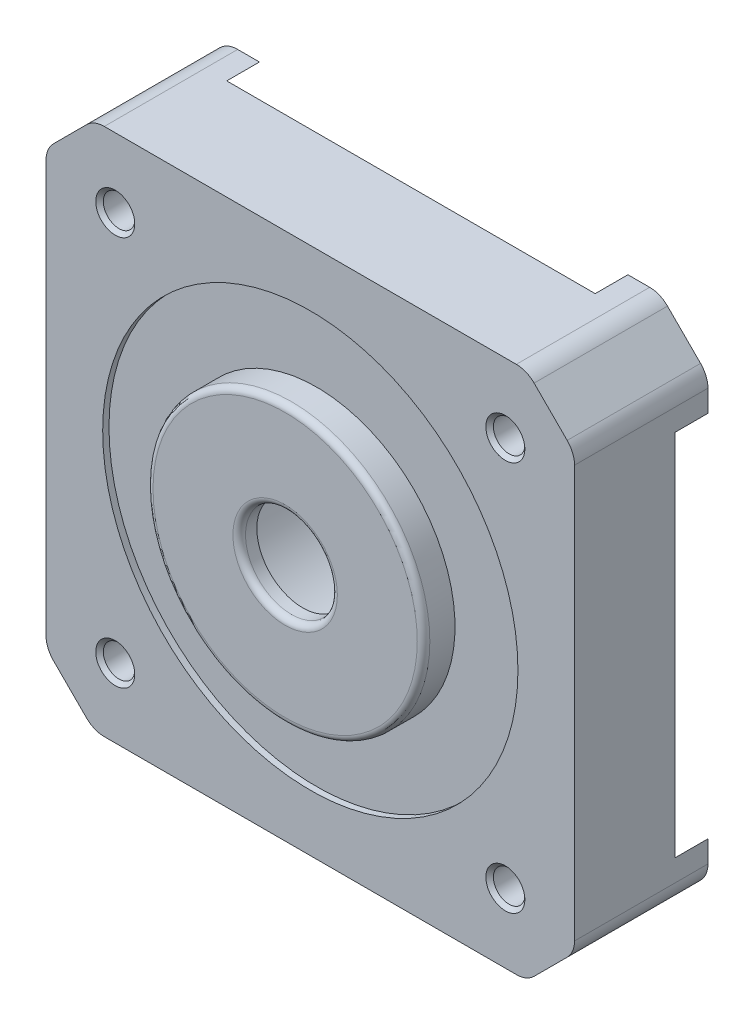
ISO-10303-21;
HEADER;
FILE_DESCRIPTION(('STEP AP214'),'2;1');
FILE_NAME('part.step','',(''),(''),'','','');
FILE_SCHEMA(('AUTOMOTIVE_DESIGN { 1 0 10303 214 1 1 1 1 }'));
ENDSEC;
DATA;
#1=APPLICATION_CONTEXT('core data for automotive mechanical design processes');
#2=APPLICATION_PROTOCOL_DEFINITION('international standard','automotive_design',2000,#1);
#3=PRODUCT_CONTEXT('',#1,'mechanical');
#4=PRODUCT('Part','Part','',(#3));
#5=PRODUCT_RELATED_PRODUCT_CATEGORY('part','',(#4));
#6=PRODUCT_DEFINITION_FORMATION('','',#4);
#7=PRODUCT_DEFINITION_CONTEXT('part definition',#1,'design');
#8=PRODUCT_DEFINITION('design','',#6,#7);
#9=PRODUCT_DEFINITION_SHAPE('','',#8);
#10=(LENGTH_UNIT() NAMED_UNIT(*) SI_UNIT(.MILLI.,.METRE.));
#11=(NAMED_UNIT(*) PLANE_ANGLE_UNIT() SI_UNIT($,.RADIAN.));
#12=(NAMED_UNIT(*) SI_UNIT($,.STERADIAN.) SOLID_ANGLE_UNIT());
#13=UNCERTAINTY_MEASURE_WITH_UNIT(LENGTH_MEASURE(1.E-05),#10,'distance_accuracy_value','');
#14=(GEOMETRIC_REPRESENTATION_CONTEXT(3) GLOBAL_UNCERTAINTY_ASSIGNED_CONTEXT((#13)) GLOBAL_UNIT_ASSIGNED_CONTEXT((#10,
#11,#12)) REPRESENTATION_CONTEXT('',''));
#15=CARTESIAN_POINT('',(0.,0.,0.));
#16=DIRECTION('',(0.,0.,1.));
#17=DIRECTION('',(1.,0.,0.));
#18=AXIS2_PLACEMENT_3D('',#15,#16,#17);
#19=CARTESIAN_POINT('',(0.,0.,42.1999999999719));
#20=DIRECTION('',(0.,0.,-1.));
#21=DIRECTION('',(-1.,0.,0.));
#22=AXIS2_PLACEMENT_3D('',#19,#20,#21);
#23=PLANE('',#22);
#24=CARTESIAN_POINT('',(-25.895502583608,120.117151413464,42.1999999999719));
#25=DIRECTION('',(0.,0.,-1.));
#26=DIRECTION('',(-1.,0.,0.));
#27=AXIS2_PLACEMENT_3D('',#24,#25,#26);
#28=CIRCLE('',#27,1.55000000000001);
#29=CARTESIAN_POINT('',(-27.445502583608,120.117151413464,42.1999999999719));
#30=VERTEX_POINT('',#29);
#31=EDGE_CURVE('E431',#30,#30,#28,.T.);
#32=ORIENTED_EDGE('',*,*,#31,.T.);
#33=EDGE_LOOP('',(#32));
#34=FACE_BOUND('',#33,.T.);
#35=CARTESIAN_POINT('',(5.10449741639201,89.1171514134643,42.1999999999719));
#36=DIRECTION('',(0.,0.,-1.));
#37=DIRECTION('',(-1.,0.,0.));
#38=AXIS2_PLACEMENT_3D('',#35,#36,#37);
#39=CIRCLE('',#38,1.55000000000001);
#40=CARTESIAN_POINT('',(3.554497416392,89.1171514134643,42.1999999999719));
#41=VERTEX_POINT('',#40);
#42=EDGE_CURVE('E428',#41,#41,#39,.T.);
#43=ORIENTED_EDGE('',*,*,#42,.T.);
#44=EDGE_LOOP('',(#43));
#45=FACE_BOUND('',#44,.T.);
#46=CARTESIAN_POINT('',(-25.895502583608,89.1171514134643,42.1999999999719));
#47=DIRECTION('',(0.,0.,-1.));
#48=DIRECTION('',(-1.,0.,0.));
#49=AXIS2_PLACEMENT_3D('',#46,#47,#48);
#50=CIRCLE('',#49,1.55000000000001);
#51=CARTESIAN_POINT('',(-27.445502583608,89.1171514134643,42.1999999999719));
#52=VERTEX_POINT('',#51);
#53=EDGE_CURVE('E425',#52,#52,#50,.T.);
#54=ORIENTED_EDGE('',*,*,#53,.T.);
#55=EDGE_LOOP('',(#54));
#56=FACE_BOUND('',#55,.T.);
#57=CARTESIAN_POINT('',(5.10449741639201,120.117151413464,42.1999999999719));
#58=DIRECTION('',(0.,0.,-1.));
#59=DIRECTION('',(-1.,0.,0.));
#60=AXIS2_PLACEMENT_3D('',#57,#58,#59);
#61=CIRCLE('',#60,1.55000000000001);
#62=CARTESIAN_POINT('',(3.554497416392,120.117151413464,42.1999999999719));
#63=VERTEX_POINT('',#62);
#64=EDGE_CURVE('E422',#63,#63,#61,.T.);
#65=ORIENTED_EDGE('',*,*,#64,.T.);
#66=EDGE_LOOP('',(#65));
#67=FACE_BOUND('',#66,.T.);
#68=DIRECTION('',(0.707106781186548,-0.707106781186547,0.));
#69=VECTOR('',#68,1.);
#70=CARTESIAN_POINT('',(6.80449741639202,125.617151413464,42.1999999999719));
#71=LINE('',#70,#69);
#72=CARTESIAN_POINT('',(7.39028385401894,125.031364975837,42.1999999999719));
#73=VERTEX_POINT('',#72);
#74=CARTESIAN_POINT('',(10.0187109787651,122.402937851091,42.1999999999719));
#75=VERTEX_POINT('',#74);
#76=EDGE_CURVE('E492',#73,#75,#71,.T.);
#77=ORIENTED_EDGE('',*,*,#76,.F.);
#78=CARTESIAN_POINT('',(5.97607029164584,123.617151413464,42.1999999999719));
#79=DIRECTION('',(0.,0.,-1.));
#80=DIRECTION('',(-1.,0.,0.));
#81=AXIS2_PLACEMENT_3D('',#78,#79,#80);
#82=CIRCLE('',#81,2.);
#83=CARTESIAN_POINT('',(5.97607029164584,125.617151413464,42.1999999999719));
#84=VERTEX_POINT('',#83);
#85=EDGE_CURVE('E365',#73,#84,#82,.F.);
#86=ORIENTED_EDGE('',*,*,#85,.T.);
#87=DIRECTION('',(1.,0.,0.));
#88=VECTOR('',#87,1.);
#89=CARTESIAN_POINT('',(-27.595502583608,125.617151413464,42.1999999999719));
#90=LINE('',#89,#88);
#91=CARTESIAN_POINT('',(-26.7670754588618,125.617151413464,42.1999999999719));
#92=VERTEX_POINT('',#91);
#93=EDGE_CURVE('E311',#92,#84,#90,.T.);
#94=ORIENTED_EDGE('',*,*,#93,.F.);
#95=CARTESIAN_POINT('',(-26.7670754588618,123.617151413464,42.1999999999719));
#96=DIRECTION('',(0.,0.,-1.));
#97=DIRECTION('',(-1.,0.,0.));
#98=AXIS2_PLACEMENT_3D('',#95,#96,#97);
#99=CIRCLE('',#98,2.);
#100=CARTESIAN_POINT('',(-28.1812890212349,125.031364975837,42.1999999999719));
#101=VERTEX_POINT('',#100);
#102=EDGE_CURVE('E375',#92,#101,#99,.F.);
#103=ORIENTED_EDGE('',*,*,#102,.T.);
#104=DIRECTION('',(0.707106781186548,0.707106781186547,0.));
#105=VECTOR('',#104,1.);
#106=CARTESIAN_POINT('',(-31.395502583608,121.817151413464,42.1999999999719));
#107=LINE('',#106,#105);
#108=CARTESIAN_POINT('',(-30.8097161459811,122.402937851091,42.1999999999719));
#109=VERTEX_POINT('',#108);
#110=EDGE_CURVE('E280',#109,#101,#107,.T.);
#111=ORIENTED_EDGE('',*,*,#110,.F.);
#112=CARTESIAN_POINT('',(-29.395502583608,120.988724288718,42.1999999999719));
#113=DIRECTION('',(0.,0.,-1.));
#114=DIRECTION('',(-1.,0.,0.));
#115=AXIS2_PLACEMENT_3D('',#112,#113,#114);
#116=CIRCLE('',#115,2.);
#117=CARTESIAN_POINT('',(-31.395502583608,120.988724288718,42.1999999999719));
#118=VERTEX_POINT('',#117);
#119=EDGE_CURVE('E381',#109,#118,#116,.F.);
#120=ORIENTED_EDGE('',*,*,#119,.T.);
#121=DIRECTION('',(0.,1.,0.));
#122=VECTOR('',#121,1.);
#123=CARTESIAN_POINT('',(-31.395502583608,87.4171514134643,42.1999999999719));
#124=LINE('',#123,#122);
#125=CARTESIAN_POINT('',(-31.395502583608,88.2455785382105,42.1999999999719));
#126=VERTEX_POINT('',#125);
#127=EDGE_CURVE('E476',#126,#118,#124,.T.);
#128=ORIENTED_EDGE('',*,*,#127,.F.);
#129=CARTESIAN_POINT('',(-29.395502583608,88.2455785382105,42.1999999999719));
#130=DIRECTION('',(0.,0.,-1.));
#131=DIRECTION('',(-1.,0.,0.));
#132=AXIS2_PLACEMENT_3D('',#129,#130,#131);
#133=CIRCLE('',#132,2.);
#134=CARTESIAN_POINT('',(-30.8097161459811,86.8313649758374,42.1999999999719));
#135=VERTEX_POINT('',#134);
#136=EDGE_CURVE('E379',#126,#135,#133,.F.);
#137=ORIENTED_EDGE('',*,*,#136,.T.);
#138=DIRECTION('',(-0.707106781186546,0.707106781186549,0.));
#139=VECTOR('',#138,1.);
#140=CARTESIAN_POINT('',(-27.595502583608,83.6171514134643,42.1999999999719));
#141=LINE('',#140,#139);
#142=CARTESIAN_POINT('',(-28.1812890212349,84.2029378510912,42.1999999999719));
#143=VERTEX_POINT('',#142);
#144=EDGE_CURVE('E479',#143,#135,#141,.T.);
#145=ORIENTED_EDGE('',*,*,#144,.F.);
#146=CARTESIAN_POINT('',(-26.7670754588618,85.6171514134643,42.1999999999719));
#147=DIRECTION('',(0.,0.,-1.));
#148=DIRECTION('',(-1.,0.,0.));
#149=AXIS2_PLACEMENT_3D('',#146,#147,#148);
#150=CIRCLE('',#149,2.);
#151=CARTESIAN_POINT('',(-26.7670754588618,83.6171514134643,42.1999999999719));
#152=VERTEX_POINT('',#151);
#153=EDGE_CURVE('E368',#143,#152,#150,.F.);
#154=ORIENTED_EDGE('',*,*,#153,.T.);
#155=DIRECTION('',(-1.,0.,0.));
#156=VECTOR('',#155,1.);
#157=CARTESIAN_POINT('',(6.80449741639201,83.6171514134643,42.1999999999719));
#158=LINE('',#157,#156);
#159=CARTESIAN_POINT('',(5.97607029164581,83.6171514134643,42.1999999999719));
#160=VERTEX_POINT('',#159);
#161=EDGE_CURVE('E483',#160,#152,#158,.T.);
#162=ORIENTED_EDGE('',*,*,#161,.F.);
#163=CARTESIAN_POINT('',(5.97607029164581,85.6171514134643,42.1999999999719));
#164=DIRECTION('',(0.,0.,-1.));
#165=DIRECTION('',(-1.,0.,0.));
#166=AXIS2_PLACEMENT_3D('',#163,#164,#165);
#167=CIRCLE('',#166,2.);
#168=CARTESIAN_POINT('',(7.39028385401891,84.2029378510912,42.1999999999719));
#169=VERTEX_POINT('',#168);
#170=EDGE_CURVE('E373',#160,#169,#167,.F.);
#171=ORIENTED_EDGE('',*,*,#170,.T.);
#172=DIRECTION('',(-0.707106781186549,-0.707106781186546,0.));
#173=VECTOR('',#172,1.);
#174=CARTESIAN_POINT('',(10.604497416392,87.4171514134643,42.1999999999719));
#175=LINE('',#174,#173);
#176=CARTESIAN_POINT('',(10.0187109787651,86.8313649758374,42.1999999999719));
#177=VERTEX_POINT('',#176);
#178=EDGE_CURVE('E487',#177,#169,#175,.T.);
#179=ORIENTED_EDGE('',*,*,#178,.F.);
#180=CARTESIAN_POINT('',(8.604497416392,88.2455785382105,42.1999999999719));
#181=DIRECTION('',(0.,0.,-1.));
#182=DIRECTION('',(-1.,0.,0.));
#183=AXIS2_PLACEMENT_3D('',#180,#181,#182);
#184=CIRCLE('',#183,2.);
#185=CARTESIAN_POINT('',(10.604497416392,88.2455785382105,42.1999999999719));
#186=VERTEX_POINT('',#185);
#187=EDGE_CURVE('E377',#177,#186,#184,.F.);
#188=ORIENTED_EDGE('',*,*,#187,.T.);
#189=DIRECTION('',(0.,-1.,0.));
#190=VECTOR('',#189,1.);
#191=CARTESIAN_POINT('',(10.604497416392,121.817151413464,42.1999999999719));
#192=LINE('',#191,#190);
#193=CARTESIAN_POINT('',(10.604497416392,120.988724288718,42.1999999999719));
#194=VERTEX_POINT('',#193);
#195=EDGE_CURVE('E490',#194,#186,#192,.T.);
#196=ORIENTED_EDGE('',*,*,#195,.F.);
#197=CARTESIAN_POINT('',(8.604497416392,120.988724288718,42.1999999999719));
#198=DIRECTION('',(0.,0.,-1.));
#199=DIRECTION('',(-1.,0.,0.));
#200=AXIS2_PLACEMENT_3D('',#197,#198,#199);
#201=CIRCLE('',#200,2.);
#202=EDGE_CURVE('E366',#194,#75,#201,.F.);
#203=ORIENTED_EDGE('',*,*,#202,.T.);
#204=EDGE_LOOP('',(#77,#86,#94,#103,#111,#120,#128,#137,#145,#154,#162,#171,#179,#188,#196,#203));
#205=FACE_BOUND('',#204,.T.);
#206=CARTESIAN_POINT('',(-10.395502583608,104.617151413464,42.1999999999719));
#207=DIRECTION('',(0.,0.,1.));
#208=DIRECTION('',(1.,0.,0.));
#209=AXIS2_PLACEMENT_3D('',#206,#207,#208);
#210=CIRCLE('',#209,16.5);
#211=CARTESIAN_POINT('',(6.10449741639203,104.617151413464,42.1999999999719));
#212=VERTEX_POINT('',#211);
#213=EDGE_CURVE('E228',#212,#212,#210,.T.);
#214=ORIENTED_EDGE('',*,*,#213,.F.);
#215=EDGE_LOOP('',(#214));
#216=FACE_BOUND('',#215,.T.);
#217=ADVANCED_FACE('F33',(#34,#45,#56,#67,#205,#216),#23,.F.);
#218=CARTESIAN_POINT('',(-10.395502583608,104.617151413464,44.1999999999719));
#219=DIRECTION('',(0.,0.,-1.));
#220=DIRECTION('',(-1.,0.,0.));
#221=AXIS2_PLACEMENT_3D('',#218,#219,#220);
#222=CYLINDRICAL_SURFACE('',#221,11.);
#223=CARTESIAN_POINT('',(-10.395502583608,104.617151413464,43.6999999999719));
#224=DIRECTION('',(0.,0.,1.));
#225=DIRECTION('',(1.,0.,0.));
#226=AXIS2_PLACEMENT_3D('',#223,#224,#225);
#227=CIRCLE('',#226,11.);
#228=CARTESIAN_POINT('',(0.60449741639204,104.617151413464,43.6999999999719));
#229=VERTEX_POINT('',#228);
#230=EDGE_CURVE('E443',#229,#229,#227,.F.);
#231=ORIENTED_EDGE('',*,*,#230,.T.);
#232=EDGE_LOOP('',(#231));
#233=FACE_BOUND('',#232,.T.);
#234=CARTESIAN_POINT('',(-10.395502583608,104.617151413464,41.6999999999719));
#235=DIRECTION('',(0.,0.,-1.));
#236=DIRECTION('',(-1.,0.,0.));
#237=AXIS2_PLACEMENT_3D('',#234,#235,#236);
#238=CIRCLE('',#237,11.);
#239=CARTESIAN_POINT('',(-21.395502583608,104.617151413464,41.6999999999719));
#240=VERTEX_POINT('',#239);
#241=EDGE_CURVE('E466',#240,#240,#238,.T.);
#242=ORIENTED_EDGE('',*,*,#241,.F.);
#243=EDGE_LOOP('',(#242));
#244=FACE_BOUND('',#243,.T.);
#245=ADVANCED_FACE('F460',(#233,#244),#222,.T.);
#246=CARTESIAN_POINT('',(0.60449741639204,104.617151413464,44.1999999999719));
#247=DIRECTION('',(0.,0.,1.));
#248=DIRECTION('',(1.,0.,0.));
#249=AXIS2_PLACEMENT_3D('',#246,#247,#248);
#250=PLANE('',#249);
#251=CARTESIAN_POINT('',(-10.395502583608,104.617151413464,44.1999999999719));
#252=DIRECTION('',(0.,0.,1.));
#253=DIRECTION('',(1.,0.,0.));
#254=AXIS2_PLACEMENT_3D('',#251,#252,#253);
#255=CIRCLE('',#254,10.5);
#256=CARTESIAN_POINT('',(0.104497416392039,104.617151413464,44.1999999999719));
#257=VERTEX_POINT('',#256);
#258=EDGE_CURVE('E41',#257,#257,#255,.T.);
#259=ORIENTED_EDGE('',*,*,#258,.T.);
#260=EDGE_LOOP('',(#259));
#261=FACE_BOUND('',#260,.T.);
#262=CARTESIAN_POINT('',(-10.395502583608,104.617151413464,44.1999999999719));
#263=DIRECTION('',(0.,0.,1.));
#264=DIRECTION('',(1.,0.,0.));
#265=AXIS2_PLACEMENT_3D('',#262,#263,#264);
#266=CIRCLE('',#265,4.15);
#267=CARTESIAN_POINT('',(-6.24550258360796,104.617151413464,44.1999999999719));
#268=VERTEX_POINT('',#267);
#269=EDGE_CURVE('E446',#268,#268,#266,.F.);
#270=ORIENTED_EDGE('',*,*,#269,.T.);
#271=EDGE_LOOP('',(#270));
#272=FACE_BOUND('',#271,.T.);
#273=ADVANCED_FACE('F451',(#261,#272),#250,.T.);
#274=CARTESIAN_POINT('',(-10.395502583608,104.617151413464,41.6999999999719));
#275=DIRECTION('',(0.,0.,-1.));
#276=DIRECTION('',(-1.,0.,0.));
#277=AXIS2_PLACEMENT_3D('',#274,#275,#276);
#278=PLANE('',#277);
#279=ORIENTED_EDGE('',*,*,#241,.T.);
#280=EDGE_LOOP('',(#279));
#281=FACE_BOUND('',#280,.T.);
#282=CARTESIAN_POINT('',(-10.395502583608,104.617151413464,41.6999999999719));
#283=DIRECTION('',(0.,0.,-1.));
#284=DIRECTION('',(-1.,0.,0.));
#285=AXIS2_PLACEMENT_3D('',#282,#283,#284);
#286=CIRCLE('',#285,16.5);
#287=CARTESIAN_POINT('',(-26.895502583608,104.617151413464,41.6999999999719));
#288=VERTEX_POINT('',#287);
#289=EDGE_CURVE('E300',#288,#288,#286,.T.);
#290=ORIENTED_EDGE('',*,*,#289,.F.);
#291=EDGE_LOOP('',(#290));
#292=FACE_BOUND('',#291,.T.);
#293=ADVANCED_FACE('F572',(#281,#292),#278,.F.);
#294=CARTESIAN_POINT('',(-10.395502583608,104.617151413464,42.1999999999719));
#295=DIRECTION('',(0.,0.,1.));
#296=DIRECTION('',(1.,0.,0.));
#297=AXIS2_PLACEMENT_3D('',#294,#295,#296);
#298=CYLINDRICAL_SURFACE('',#297,16.5);
#299=ORIENTED_EDGE('',*,*,#213,.T.);
#300=EDGE_LOOP('',(#299));
#301=FACE_BOUND('',#300,.T.);
#302=ORIENTED_EDGE('',*,*,#289,.T.);
#303=EDGE_LOOP('',(#302));
#304=FACE_BOUND('',#303,.T.);
#305=ADVANCED_FACE('F564',(#301,#304),#298,.F.);
#306=CARTESIAN_POINT('',(-31.395502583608,121.817151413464,42.1999999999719));
#307=DIRECTION('',(-0.707106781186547,0.707106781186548,0.));
#308=DIRECTION('',(-0.707106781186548,-0.707106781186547,0.));
#309=AXIS2_PLACEMENT_3D('',#306,#307,#308);
#310=PLANE('',#309);
#311=DIRECTION('',(0.707106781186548,0.707106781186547,0.));
#312=VECTOR('',#311,1.);
#313=CARTESIAN_POINT('',(-27.595502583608,125.617151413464,31.5999999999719));
#314=LINE('',#313,#312);
#315=CARTESIAN_POINT('',(-30.8097161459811,122.402937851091,31.5999999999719));
#316=VERTEX_POINT('',#315);
#317=CARTESIAN_POINT('',(-28.1812890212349,125.031364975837,31.5999999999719));
#318=VERTEX_POINT('',#317);
#319=EDGE_CURVE('E230',#316,#318,#314,.T.);
#320=ORIENTED_EDGE('',*,*,#319,.F.);
#321=DIRECTION('',(0.,0.,-1.));
#322=VECTOR('',#321,1.);
#323=CARTESIAN_POINT('',(-30.8097161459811,122.402937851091,42.1999999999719));
#324=LINE('',#323,#322);
#325=EDGE_CURVE('E395',#316,#109,#324,.F.);
#326=ORIENTED_EDGE('',*,*,#325,.T.);
#327=ORIENTED_EDGE('',*,*,#110,.T.);
#328=DIRECTION('',(0.,0.,-1.));
#329=VECTOR('',#328,1.);
#330=CARTESIAN_POINT('',(-28.1812890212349,125.031364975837,42.1999999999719));
#331=LINE('',#330,#329);
#332=EDGE_CURVE('E392',#101,#318,#331,.T.);
#333=ORIENTED_EDGE('',*,*,#332,.T.);
#334=EDGE_LOOP('',(#320,#326,#327,#333));
#335=FACE_BOUND('',#334,.T.);
#336=ADVANCED_FACE('F505',(#335),#310,.T.);
#337=CARTESIAN_POINT('',(-31.395502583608,87.4171514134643,42.1999999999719));
#338=DIRECTION('',(-1.,0.,0.));
#339=DIRECTION('',(0.,0.,1.));
#340=AXIS2_PLACEMENT_3D('',#337,#338,#339);
#341=PLANE('',#340);
#342=ORIENTED_EDGE('',*,*,#127,.T.);
#343=DIRECTION('',(0.,0.,-1.));
#344=VECTOR('',#343,1.);
#345=CARTESIAN_POINT('',(-31.395502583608,120.988724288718,42.1999999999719));
#346=LINE('',#345,#344);
#347=CARTESIAN_POINT('',(-31.395502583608,120.988724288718,31.5999999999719));
#348=VERTEX_POINT('',#347);
#349=EDGE_CURVE('E386',#118,#348,#346,.T.);
#350=ORIENTED_EDGE('',*,*,#349,.T.);
#351=DIRECTION('',(0.,1.,0.));
#352=VECTOR('',#351,1.);
#353=CARTESIAN_POINT('',(-31.395502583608,121.817151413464,31.5999999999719));
#354=LINE('',#353,#352);
#355=CARTESIAN_POINT('',(-31.395502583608,119.258189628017,31.5999999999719));
#356=VERTEX_POINT('',#355);
#357=EDGE_CURVE('E237',#356,#348,#354,.T.);
#358=ORIENTED_EDGE('',*,*,#357,.F.);
#359=DIRECTION('',(0.,0.,1.));
#360=VECTOR('',#359,1.);
#361=CARTESIAN_POINT('',(-31.395502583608,119.258189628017,31.5999999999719));
#362=LINE('',#361,#360);
#363=CARTESIAN_POINT('',(-31.395502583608,119.258189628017,34.1999999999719));
#364=VERTEX_POINT('',#363);
#365=EDGE_CURVE('E240',#356,#364,#362,.T.);
#366=ORIENTED_EDGE('',*,*,#365,.T.);
#367=DIRECTION('',(0.,1.,0.));
#368=VECTOR('',#367,1.);
#369=CARTESIAN_POINT('',(-31.395502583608,87.4171514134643,34.1999999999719));
#370=LINE('',#369,#368);
#371=CARTESIAN_POINT('',(-31.395502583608,89.9761131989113,34.1999999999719));
#372=VERTEX_POINT('',#371);
#373=EDGE_CURVE('E306',#372,#364,#370,.T.);
#374=ORIENTED_EDGE('',*,*,#373,.F.);
#375=DIRECTION('',(0.,0.,1.));
#376=VECTOR('',#375,1.);
#377=CARTESIAN_POINT('',(-31.395502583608,89.9761131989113,31.5999999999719));
#378=LINE('',#377,#376);
#379=CARTESIAN_POINT('',(-31.395502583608,89.9761131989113,31.5999999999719));
#380=VERTEX_POINT('',#379);
#381=EDGE_CURVE('E264',#380,#372,#378,.T.);
#382=ORIENTED_EDGE('',*,*,#381,.F.);
#383=DIRECTION('',(0.,1.,0.));
#384=VECTOR('',#383,1.);
#385=CARTESIAN_POINT('',(-31.395502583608,89.9761131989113,31.5999999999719));
#386=LINE('',#385,#384);
#387=CARTESIAN_POINT('',(-31.395502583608,88.2455785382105,31.5999999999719));
#388=VERTEX_POINT('',#387);
#389=EDGE_CURVE('E252',#388,#380,#386,.T.);
#390=ORIENTED_EDGE('',*,*,#389,.F.);
#391=DIRECTION('',(0.,0.,-1.));
#392=VECTOR('',#391,1.);
#393=CARTESIAN_POINT('',(-31.395502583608,88.2455785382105,42.1999999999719));
#394=LINE('',#393,#392);
#395=EDGE_CURVE('E384',#388,#126,#394,.F.);
#396=ORIENTED_EDGE('',*,*,#395,.T.);
#397=EDGE_LOOP('',(#342,#350,#358,#366,#374,#382,#390,#396));
#398=FACE_BOUND('',#397,.T.);
#399=ADVANCED_FACE('F336',(#398),#341,.T.);
#400=CARTESIAN_POINT('',(-27.595502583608,83.6171514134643,42.1999999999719));
#401=DIRECTION('',(-0.707106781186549,-0.707106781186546,0.));
#402=DIRECTION('',(0.707106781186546,-0.707106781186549,0.));
#403=AXIS2_PLACEMENT_3D('',#400,#401,#402);
#404=PLANE('',#403);
#405=ORIENTED_EDGE('',*,*,#144,.T.);
#406=DIRECTION('',(0.,0.,-1.));
#407=VECTOR('',#406,1.);
#408=CARTESIAN_POINT('',(-30.8097161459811,86.8313649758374,42.1999999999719));
#409=LINE('',#408,#407);
#410=CARTESIAN_POINT('',(-30.8097161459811,86.8313649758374,31.5999999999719));
#411=VERTEX_POINT('',#410);
#412=EDGE_CURVE('E399',#135,#411,#409,.T.);
#413=ORIENTED_EDGE('',*,*,#412,.T.);
#414=DIRECTION('',(-0.707106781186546,0.707106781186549,0.));
#415=VECTOR('',#414,1.);
#416=CARTESIAN_POINT('',(-31.395502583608,87.4171514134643,31.5999999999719));
#417=LINE('',#416,#415);
#418=CARTESIAN_POINT('',(-28.1812890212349,84.2029378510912,31.5999999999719));
#419=VERTEX_POINT('',#418);
#420=EDGE_CURVE('E249',#419,#411,#417,.T.);
#421=ORIENTED_EDGE('',*,*,#420,.F.);
#422=DIRECTION('',(0.,0.,-1.));
#423=VECTOR('',#422,1.);
#424=CARTESIAN_POINT('',(-28.1812890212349,84.2029378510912,42.1999999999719));
#425=LINE('',#424,#423);
#426=EDGE_CURVE('E397',#419,#143,#425,.F.);
#427=ORIENTED_EDGE('',*,*,#426,.T.);
#428=EDGE_LOOP('',(#405,#413,#421,#427));
#429=FACE_BOUND('',#428,.T.);
#430=ADVANCED_FACE('F518',(#429),#404,.T.);
#431=CARTESIAN_POINT('',(6.80449741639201,83.6171514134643,42.1999999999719));
#432=DIRECTION('',(0.,-1.,0.));
#433=DIRECTION('',(0.,0.,-1.));
#434=AXIS2_PLACEMENT_3D('',#431,#432,#433);
#435=PLANE('',#434);
#436=DIRECTION('',(-1.,0.,0.));
#437=VECTOR('',#436,1.);
#438=CARTESIAN_POINT('',(4.24553563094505,83.6171514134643,31.5999999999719));
#439=LINE('',#438,#437);
#440=CARTESIAN_POINT('',(5.97607029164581,83.6171514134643,31.5999999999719));
#441=VERTEX_POINT('',#440);
#442=CARTESIAN_POINT('',(4.24553563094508,83.6171514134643,31.5999999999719));
#443=VERTEX_POINT('',#442);
#444=EDGE_CURVE('E270',#441,#443,#439,.T.);
#445=ORIENTED_EDGE('',*,*,#444,.F.);
#446=DIRECTION('',(0.,0.,-1.));
#447=VECTOR('',#446,1.);
#448=CARTESIAN_POINT('',(5.97607029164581,83.6171514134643,42.1999999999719));
#449=LINE('',#448,#447);
#450=EDGE_CURVE('E417',#441,#160,#449,.F.);
#451=ORIENTED_EDGE('',*,*,#450,.T.);
#452=ORIENTED_EDGE('',*,*,#161,.T.);
#453=DIRECTION('',(0.,0.,-1.));
#454=VECTOR('',#453,1.);
#455=CARTESIAN_POINT('',(-26.7670754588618,83.6171514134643,42.1999999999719));
#456=LINE('',#455,#454);
#457=CARTESIAN_POINT('',(-26.7670754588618,83.6171514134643,31.5999999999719));
#458=VERTEX_POINT('',#457);
#459=EDGE_CURVE('E326',#152,#458,#456,.T.);
#460=ORIENTED_EDGE('',*,*,#459,.T.);
#461=DIRECTION('',(-1.,0.,0.));
#462=VECTOR('',#461,1.);
#463=CARTESIAN_POINT('',(-27.595502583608,83.6171514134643,31.5999999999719));
#464=LINE('',#463,#462);
#465=CARTESIAN_POINT('',(-25.036540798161,83.6171514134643,31.5999999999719));
#466=VERTEX_POINT('',#465);
#467=EDGE_CURVE('E256',#466,#458,#464,.T.);
#468=ORIENTED_EDGE('',*,*,#467,.F.);
#469=DIRECTION('',(0.,0.,1.));
#470=VECTOR('',#469,1.);
#471=CARTESIAN_POINT('',(-25.036540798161,83.6171514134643,31.5999999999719));
#472=LINE('',#471,#470);
#473=CARTESIAN_POINT('',(-25.036540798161,83.6171514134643,34.1999999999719));
#474=VERTEX_POINT('',#473);
#475=EDGE_CURVE('E259',#466,#474,#472,.T.);
#476=ORIENTED_EDGE('',*,*,#475,.T.);
#477=DIRECTION('',(-1.,0.,0.));
#478=VECTOR('',#477,1.);
#479=CARTESIAN_POINT('',(6.80449741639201,83.6171514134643,34.1999999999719));
#480=LINE('',#479,#478);
#481=CARTESIAN_POINT('',(4.2455356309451,83.6171514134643,34.1999999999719));
#482=VERTEX_POINT('',#481);
#483=EDGE_CURVE('E286',#482,#474,#480,.T.);
#484=ORIENTED_EDGE('',*,*,#483,.F.);
#485=DIRECTION('',(0.,0.,1.));
#486=VECTOR('',#485,1.);
#487=CARTESIAN_POINT('',(4.24553563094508,83.6171514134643,31.5999999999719));
#488=LINE('',#487,#486);
#489=EDGE_CURVE('E290',#443,#482,#488,.T.);
#490=ORIENTED_EDGE('',*,*,#489,.F.);
#491=EDGE_LOOP('',(#445,#451,#452,#460,#468,#476,#484,#490));
#492=FACE_BOUND('',#491,.T.);
#493=ADVANCED_FACE('F322',(#492),#435,.T.);
#494=CARTESIAN_POINT('',(10.604497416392,87.4171514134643,42.1999999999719));
#495=DIRECTION('',(0.707106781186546,-0.707106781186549,0.));
#496=DIRECTION('',(0.707106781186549,0.707106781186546,0.));
#497=AXIS2_PLACEMENT_3D('',#494,#495,#496);
#498=PLANE('',#497);
#499=DIRECTION('',(-0.707106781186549,-0.707106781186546,0.));
#500=VECTOR('',#499,1.);
#501=CARTESIAN_POINT('',(6.80449741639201,83.6171514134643,31.5999999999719));
#502=LINE('',#501,#500);
#503=CARTESIAN_POINT('',(10.0187109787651,86.8313649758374,31.5999999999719));
#504=VERTEX_POINT('',#503);
#505=CARTESIAN_POINT('',(7.39028385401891,84.2029378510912,31.5999999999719));
#506=VERTEX_POINT('',#505);
#507=EDGE_CURVE('E268',#504,#506,#502,.T.);
#508=ORIENTED_EDGE('',*,*,#507,.F.);
#509=DIRECTION('',(0.,0.,-1.));
#510=VECTOR('',#509,1.);
#511=CARTESIAN_POINT('',(10.0187109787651,86.8313649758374,42.1999999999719));
#512=LINE('',#511,#510);
#513=EDGE_CURVE('E414',#504,#177,#512,.F.);
#514=ORIENTED_EDGE('',*,*,#513,.T.);
#515=ORIENTED_EDGE('',*,*,#178,.T.);
#516=DIRECTION('',(0.,0.,-1.));
#517=VECTOR('',#516,1.);
#518=CARTESIAN_POINT('',(7.39028385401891,84.2029378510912,42.1999999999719));
#519=LINE('',#518,#517);
#520=EDGE_CURVE('E412',#169,#506,#519,.T.);
#521=ORIENTED_EDGE('',*,*,#520,.T.);
#522=EDGE_LOOP('',(#508,#514,#515,#521));
#523=FACE_BOUND('',#522,.T.);
#524=ADVANCED_FACE('F552',(#523),#498,.T.);
#525=CARTESIAN_POINT('',(10.604497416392,121.817151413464,42.1999999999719));
#526=DIRECTION('',(1.,0.,0.));
#527=DIRECTION('',(0.,1.,0.));
#528=AXIS2_PLACEMENT_3D('',#525,#526,#527);
#529=PLANE('',#528);
#530=ORIENTED_EDGE('',*,*,#195,.T.);
#531=DIRECTION('',(0.,0.,-1.));
#532=VECTOR('',#531,1.);
#533=CARTESIAN_POINT('',(10.604497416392,88.2455785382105,42.1999999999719));
#534=LINE('',#533,#532);
#535=CARTESIAN_POINT('',(10.604497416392,88.2455785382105,31.5999999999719));
#536=VERTEX_POINT('',#535);
#537=EDGE_CURVE('E406',#186,#536,#534,.T.);
#538=ORIENTED_EDGE('',*,*,#537,.T.);
#539=DIRECTION('',(0.,-1.,0.));
#540=VECTOR('',#539,1.);
#541=CARTESIAN_POINT('',(10.604497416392,87.4171514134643,31.5999999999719));
#542=LINE('',#541,#540);
#543=CARTESIAN_POINT('',(10.604497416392,89.9761131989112,31.5999999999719));
#544=VERTEX_POINT('',#543);
#545=EDGE_CURVE('E274',#544,#536,#542,.T.);
#546=ORIENTED_EDGE('',*,*,#545,.F.);
#547=DIRECTION('',(0.,0.,1.));
#548=VECTOR('',#547,1.);
#549=CARTESIAN_POINT('',(10.604497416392,89.9761131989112,31.5999999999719));
#550=LINE('',#549,#548);
#551=CARTESIAN_POINT('',(10.604497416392,89.9761131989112,34.1999999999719));
#552=VERTEX_POINT('',#551);
#553=EDGE_CURVE('E277',#544,#552,#550,.T.);
#554=ORIENTED_EDGE('',*,*,#553,.T.);
#555=DIRECTION('',(0.,-1.,0.));
#556=VECTOR('',#555,1.);
#557=CARTESIAN_POINT('',(10.604497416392,121.817151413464,34.1999999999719));
#558=LINE('',#557,#556);
#559=CARTESIAN_POINT('',(10.604497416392,119.258189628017,34.1999999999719));
#560=VERTEX_POINT('',#559);
#561=EDGE_CURVE('E212',#560,#552,#558,.T.);
#562=ORIENTED_EDGE('',*,*,#561,.F.);
#563=DIRECTION('',(0.,0.,1.));
#564=VECTOR('',#563,1.);
#565=CARTESIAN_POINT('',(10.604497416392,119.258189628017,31.5999999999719));
#566=LINE('',#565,#564);
#567=CARTESIAN_POINT('',(10.604497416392,119.258189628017,31.5999999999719));
#568=VERTEX_POINT('',#567);
#569=EDGE_CURVE('E208',#568,#560,#566,.T.);
#570=ORIENTED_EDGE('',*,*,#569,.F.);
#571=DIRECTION('',(0.,-1.,0.));
#572=VECTOR('',#571,1.);
#573=CARTESIAN_POINT('',(10.604497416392,119.258189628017,31.5999999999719));
#574=LINE('',#573,#572);
#575=CARTESIAN_POINT('',(10.604497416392,120.988724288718,31.5999999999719));
#576=VERTEX_POINT('',#575);
#577=EDGE_CURVE('E193',#576,#568,#574,.T.);
#578=ORIENTED_EDGE('',*,*,#577,.F.);
#579=DIRECTION('',(0.,0.,-1.));
#580=VECTOR('',#579,1.);
#581=CARTESIAN_POINT('',(10.604497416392,120.988724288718,42.1999999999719));
#582=LINE('',#581,#580);
#583=EDGE_CURVE('E404',#576,#194,#582,.F.);
#584=ORIENTED_EDGE('',*,*,#583,.T.);
#585=EDGE_LOOP('',(#530,#538,#546,#554,#562,#570,#578,#584));
#586=FACE_BOUND('',#585,.T.);
#587=ADVANCED_FACE('F210',(#586),#529,.T.);
#588=CARTESIAN_POINT('',(6.80449741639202,125.617151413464,42.1999999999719));
#589=DIRECTION('',(0.707106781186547,0.707106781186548,0.));
#590=DIRECTION('',(-0.707106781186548,0.707106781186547,0.));
#591=AXIS2_PLACEMENT_3D('',#588,#589,#590);
#592=PLANE('',#591);
#593=DIRECTION('',(0.707106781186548,-0.707106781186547,0.));
#594=VECTOR('',#593,1.);
#595=CARTESIAN_POINT('',(10.604497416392,121.817151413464,31.5999999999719));
#596=LINE('',#595,#594);
#597=CARTESIAN_POINT('',(7.39028385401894,125.031364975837,31.5999999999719));
#598=VERTEX_POINT('',#597);
#599=CARTESIAN_POINT('',(10.0187109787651,122.402937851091,31.5999999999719));
#600=VERTEX_POINT('',#599);
#601=EDGE_CURVE('E204',#598,#600,#596,.T.);
#602=ORIENTED_EDGE('',*,*,#601,.F.);
#603=DIRECTION('',(0.,0.,-1.));
#604=VECTOR('',#603,1.);
#605=CARTESIAN_POINT('',(7.39028385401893,125.031364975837,42.1999999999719));
#606=LINE('',#605,#604);
#607=EDGE_CURVE('E360',#598,#73,#606,.F.);
#608=ORIENTED_EDGE('',*,*,#607,.T.);
#609=ORIENTED_EDGE('',*,*,#76,.T.);
#610=DIRECTION('',(0.,0.,-1.));
#611=VECTOR('',#610,1.);
#612=CARTESIAN_POINT('',(10.0187109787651,122.402937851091,42.1999999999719));
#613=LINE('',#612,#611);
#614=EDGE_CURVE('E354',#75,#600,#613,.T.);
#615=ORIENTED_EDGE('',*,*,#614,.T.);
#616=EDGE_LOOP('',(#602,#608,#609,#615));
#617=FACE_BOUND('',#616,.T.);
#618=ADVANCED_FACE('F358',(#617),#592,.T.);
#619=CARTESIAN_POINT('',(-27.595502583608,125.617151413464,42.1999999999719));
#620=DIRECTION('',(0.,1.,0.));
#621=DIRECTION('',(0.,0.,1.));
#622=AXIS2_PLACEMENT_3D('',#619,#620,#621);
#623=PLANE('',#622);
#624=ORIENTED_EDGE('',*,*,#93,.T.);
#625=DIRECTION('',(0.,0.,-1.));
#626=VECTOR('',#625,1.);
#627=CARTESIAN_POINT('',(5.97607029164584,125.617151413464,42.1999999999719));
#628=LINE('',#627,#626);
#629=CARTESIAN_POINT('',(5.97607029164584,125.617151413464,31.5999999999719));
#630=VERTEX_POINT('',#629);
#631=EDGE_CURVE('E349',#84,#630,#628,.T.);
#632=ORIENTED_EDGE('',*,*,#631,.T.);
#633=DIRECTION('',(1.,0.,0.));
#634=VECTOR('',#633,1.);
#635=CARTESIAN_POINT('',(6.80449741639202,125.617151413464,31.5999999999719));
#636=LINE('',#635,#634);
#637=CARTESIAN_POINT('',(4.245535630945,125.617151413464,31.5999999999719));
#638=VERTEX_POINT('',#637);
#639=EDGE_CURVE('E221',#638,#630,#636,.T.);
#640=ORIENTED_EDGE('',*,*,#639,.F.);
#641=DIRECTION('',(0.,0.,1.));
#642=VECTOR('',#641,1.);
#643=CARTESIAN_POINT('',(4.245535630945,125.617151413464,31.5999999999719));
#644=LINE('',#643,#642);
#645=CARTESIAN_POINT('',(4.245535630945,125.617151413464,34.1999999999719));
#646=VERTEX_POINT('',#645);
#647=EDGE_CURVE('E216',#638,#646,#644,.T.);
#648=ORIENTED_EDGE('',*,*,#647,.T.);
#649=DIRECTION('',(1.,0.,0.));
#650=VECTOR('',#649,1.);
#651=CARTESIAN_POINT('',(-27.595502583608,125.617151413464,34.1999999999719));
#652=LINE('',#651,#650);
#653=CARTESIAN_POINT('',(-25.0365407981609,125.617151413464,34.1999999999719));
#654=VERTEX_POINT('',#653);
#655=EDGE_CURVE('E295',#654,#646,#652,.T.);
#656=ORIENTED_EDGE('',*,*,#655,.F.);
#657=DIRECTION('',(0.,0.,1.));
#658=VECTOR('',#657,1.);
#659=CARTESIAN_POINT('',(-25.0365407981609,125.617151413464,31.5999999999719));
#660=LINE('',#659,#658);
#661=CARTESIAN_POINT('',(-25.0365407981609,125.617151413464,31.5999999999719));
#662=VERTEX_POINT('',#661);
#663=EDGE_CURVE('E245',#662,#654,#660,.T.);
#664=ORIENTED_EDGE('',*,*,#663,.F.);
#665=DIRECTION('',(1.,0.,0.));
#666=VECTOR('',#665,1.);
#667=CARTESIAN_POINT('',(-25.0365407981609,125.617151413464,31.5999999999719));
#668=LINE('',#667,#666);
#669=CARTESIAN_POINT('',(-26.7670754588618,125.617151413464,31.5999999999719));
#670=VERTEX_POINT('',#669);
#671=EDGE_CURVE('E233',#670,#662,#668,.T.);
#672=ORIENTED_EDGE('',*,*,#671,.F.);
#673=DIRECTION('',(0.,0.,-1.));
#674=VECTOR('',#673,1.);
#675=CARTESIAN_POINT('',(-26.7670754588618,125.617151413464,42.1999999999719));
#676=LINE('',#675,#674);
#677=EDGE_CURVE('E468',#670,#92,#676,.F.);
#678=ORIENTED_EDGE('',*,*,#677,.T.);
#679=EDGE_LOOP('',(#624,#632,#640,#648,#656,#664,#672,#678));
#680=FACE_BOUND('',#679,.T.);
#681=ADVANCED_FACE('F346',(#680),#623,.T.);
#682=CARTESIAN_POINT('',(-10.395502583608,104.617151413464,31.5999999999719));
#683=DIRECTION('',(0.,0.,1.));
#684=DIRECTION('',(1.,0.,0.));
#685=AXIS2_PLACEMENT_3D('',#682,#683,#684);
#686=CYLINDRICAL_SURFACE('',#685,25.6);
#687=CARTESIAN_POINT('',(-10.395502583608,104.617151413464,34.1999999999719));
#688=DIRECTION('',(0.,0.,1.));
#689=DIRECTION('',(-1.,0.,0.));
#690=AXIS2_PLACEMENT_3D('',#687,#688,#689);
#691=CIRCLE('',#690,25.6);
#692=EDGE_CURVE('E267',#482,#552,#691,.T.);
#693=ORIENTED_EDGE('',*,*,#692,.T.);
#694=ORIENTED_EDGE('',*,*,#553,.F.);
#695=CARTESIAN_POINT('',(-10.395502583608,104.617151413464,31.5999999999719));
#696=DIRECTION('',(0.,0.,1.));
#697=DIRECTION('',(-1.,0.,0.));
#698=AXIS2_PLACEMENT_3D('',#695,#696,#697);
#699=CIRCLE('',#698,25.6);
#700=EDGE_CURVE('E272',#443,#544,#699,.T.);
#701=ORIENTED_EDGE('',*,*,#700,.F.);
#702=ORIENTED_EDGE('',*,*,#489,.T.);
#703=EDGE_LOOP('',(#693,#694,#701,#702));
#704=FACE_BOUND('',#703,.T.);
#705=ADVANCED_FACE('F544',(#704),#686,.F.);
#706=CARTESIAN_POINT('',(-10.395502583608,104.617151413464,31.5999999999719));
#707=DIRECTION('',(0.,0.,-1.));
#708=DIRECTION('',(-1.,0.,0.));
#709=AXIS2_PLACEMENT_3D('',#706,#707,#708);
#710=PLANE('',#709);
#711=ORIENTED_EDGE('',*,*,#545,.T.);
#712=CARTESIAN_POINT('',(8.604497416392,88.2455785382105,31.5999999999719));
#713=DIRECTION('',(0.,0.,-1.));
#714=DIRECTION('',(-1.,0.,0.));
#715=AXIS2_PLACEMENT_3D('',#712,#713,#714);
#716=CIRCLE('',#715,2.);
#717=EDGE_CURVE('E410',#536,#504,#716,.T.);
#718=ORIENTED_EDGE('',*,*,#717,.T.);
#719=ORIENTED_EDGE('',*,*,#507,.T.);
#720=CARTESIAN_POINT('',(5.97607029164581,85.6171514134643,31.5999999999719));
#721=DIRECTION('',(0.,0.,-1.));
#722=DIRECTION('',(-1.,0.,0.));
#723=AXIS2_PLACEMENT_3D('',#720,#721,#722);
#724=CIRCLE('',#723,2.);
#725=EDGE_CURVE('E48',#506,#441,#724,.T.);
#726=ORIENTED_EDGE('',*,*,#725,.T.);
#727=ORIENTED_EDGE('',*,*,#444,.T.);
#728=ORIENTED_EDGE('',*,*,#700,.T.);
#729=EDGE_LOOP('',(#711,#718,#719,#726,#727,#728));
#730=FACE_BOUND('',#729,.T.);
#731=ADVANCED_FACE('F774',(#730),#710,.T.);
#732=CARTESIAN_POINT('',(-10.395502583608,104.617151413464,31.5999999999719));
#733=DIRECTION('',(0.,0.,1.));
#734=DIRECTION('',(1.,0.,0.));
#735=AXIS2_PLACEMENT_3D('',#732,#733,#734);
#736=CYLINDRICAL_SURFACE('',#735,25.6);
#737=CARTESIAN_POINT('',(-10.395502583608,104.617151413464,34.1999999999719));
#738=DIRECTION('',(0.,0.,1.));
#739=DIRECTION('',(-1.,0.,0.));
#740=AXIS2_PLACEMENT_3D('',#737,#738,#739);
#741=CIRCLE('',#740,25.6);
#742=EDGE_CURVE('E248',#372,#474,#741,.T.);
#743=ORIENTED_EDGE('',*,*,#742,.T.);
#744=ORIENTED_EDGE('',*,*,#475,.F.);
#745=CARTESIAN_POINT('',(-10.395502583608,104.617151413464,31.5999999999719));
#746=DIRECTION('',(0.,0.,1.));
#747=DIRECTION('',(-1.,0.,0.));
#748=AXIS2_PLACEMENT_3D('',#745,#746,#747);
#749=CIRCLE('',#748,25.6);
#750=EDGE_CURVE('E254',#380,#466,#749,.T.);
#751=ORIENTED_EDGE('',*,*,#750,.F.);
#752=ORIENTED_EDGE('',*,*,#381,.T.);
#753=EDGE_LOOP('',(#743,#744,#751,#752));
#754=FACE_BOUND('',#753,.T.);
#755=ADVANCED_FACE('F318',(#754),#736,.F.);
#756=CARTESIAN_POINT('',(-10.395502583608,104.617151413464,31.5999999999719));
#757=DIRECTION('',(0.,0.,-1.));
#758=DIRECTION('',(-1.,0.,0.));
#759=AXIS2_PLACEMENT_3D('',#756,#757,#758);
#760=PLANE('',#759);
#761=ORIENTED_EDGE('',*,*,#420,.T.);
#762=CARTESIAN_POINT('',(-29.395502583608,88.2455785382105,31.5999999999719));
#763=DIRECTION('',(0.,0.,-1.));
#764=DIRECTION('',(-1.,0.,0.));
#765=AXIS2_PLACEMENT_3D('',#762,#763,#764);
#766=CIRCLE('',#765,2.);
#767=EDGE_CURVE('E332',#411,#388,#766,.T.);
#768=ORIENTED_EDGE('',*,*,#767,.T.);
#769=ORIENTED_EDGE('',*,*,#389,.T.);
#770=ORIENTED_EDGE('',*,*,#750,.T.);
#771=ORIENTED_EDGE('',*,*,#467,.T.);
#772=CARTESIAN_POINT('',(-26.7670754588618,85.6171514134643,31.5999999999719));
#773=DIRECTION('',(0.,0.,-1.));
#774=DIRECTION('',(-1.,0.,0.));
#775=AXIS2_PLACEMENT_3D('',#772,#773,#774);
#776=CIRCLE('',#775,2.);
#777=EDGE_CURVE('E329',#458,#419,#776,.T.);
#778=ORIENTED_EDGE('',*,*,#777,.T.);
#779=EDGE_LOOP('',(#761,#768,#769,#770,#771,#778));
#780=FACE_BOUND('',#779,.T.);
#781=ADVANCED_FACE('F328',(#780),#760,.T.);
#782=CARTESIAN_POINT('',(-10.395502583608,104.617151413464,31.5999999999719));
#783=DIRECTION('',(0.,0.,1.));
#784=DIRECTION('',(1.,0.,0.));
#785=AXIS2_PLACEMENT_3D('',#782,#783,#784);
#786=CYLINDRICAL_SURFACE('',#785,25.6);
#787=CARTESIAN_POINT('',(-10.395502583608,104.617151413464,34.1999999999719));
#788=DIRECTION('',(0.,0.,1.));
#789=DIRECTION('',(-1.,0.,0.));
#790=AXIS2_PLACEMENT_3D('',#787,#788,#789);
#791=CIRCLE('',#790,25.6);
#792=EDGE_CURVE('E215',#654,#364,#791,.T.);
#793=ORIENTED_EDGE('',*,*,#792,.T.);
#794=ORIENTED_EDGE('',*,*,#365,.F.);
#795=CARTESIAN_POINT('',(-10.395502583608,104.617151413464,31.5999999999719));
#796=DIRECTION('',(0.,0.,1.));
#797=DIRECTION('',(-1.,0.,0.));
#798=AXIS2_PLACEMENT_3D('',#795,#796,#797);
#799=CIRCLE('',#798,25.6);
#800=EDGE_CURVE('E235',#662,#356,#799,.T.);
#801=ORIENTED_EDGE('',*,*,#800,.F.);
#802=ORIENTED_EDGE('',*,*,#663,.T.);
#803=EDGE_LOOP('',(#793,#794,#801,#802));
#804=FACE_BOUND('',#803,.T.);
#805=ADVANCED_FACE('F342',(#804),#786,.F.);
#806=CARTESIAN_POINT('',(-10.395502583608,104.617151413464,31.5999999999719));
#807=DIRECTION('',(0.,0.,-1.));
#808=DIRECTION('',(-1.,0.,0.));
#809=AXIS2_PLACEMENT_3D('',#806,#807,#808);
#810=PLANE('',#809);
#811=ORIENTED_EDGE('',*,*,#357,.T.);
#812=CARTESIAN_POINT('',(-29.395502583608,120.988724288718,31.5999999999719));
#813=DIRECTION('',(0.,0.,-1.));
#814=DIRECTION('',(-1.,0.,0.));
#815=AXIS2_PLACEMENT_3D('',#812,#813,#814);
#816=CIRCLE('',#815,2.);
#817=EDGE_CURVE('E390',#348,#316,#816,.T.);
#818=ORIENTED_EDGE('',*,*,#817,.T.);
#819=ORIENTED_EDGE('',*,*,#319,.T.);
#820=CARTESIAN_POINT('',(-26.7670754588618,123.617151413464,31.5999999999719));
#821=DIRECTION('',(0.,0.,-1.));
#822=DIRECTION('',(-1.,0.,0.));
#823=AXIS2_PLACEMENT_3D('',#820,#821,#822);
#824=CIRCLE('',#823,2.);
#825=EDGE_CURVE('E388',#318,#670,#824,.T.);
#826=ORIENTED_EDGE('',*,*,#825,.T.);
#827=ORIENTED_EDGE('',*,*,#671,.T.);
#828=ORIENTED_EDGE('',*,*,#800,.T.);
#829=EDGE_LOOP('',(#811,#818,#819,#826,#827,#828));
#830=FACE_BOUND('',#829,.T.);
#831=ADVANCED_FACE('F508',(#830),#810,.T.);
#832=CARTESIAN_POINT('',(-10.395502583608,104.617151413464,31.5999999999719));
#833=DIRECTION('',(0.,0.,1.));
#834=DIRECTION('',(1.,0.,0.));
#835=AXIS2_PLACEMENT_3D('',#832,#833,#834);
#836=CYLINDRICAL_SURFACE('',#835,25.6);
#837=CARTESIAN_POINT('',(-10.395502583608,104.617151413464,34.1999999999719));
#838=DIRECTION('',(0.,0.,1.));
#839=DIRECTION('',(-1.,0.,0.));
#840=AXIS2_PLACEMENT_3D('',#837,#838,#839);
#841=CIRCLE('',#840,25.6);
#842=EDGE_CURVE('E226',#560,#646,#841,.T.);
#843=ORIENTED_EDGE('',*,*,#842,.T.);
#844=ORIENTED_EDGE('',*,*,#647,.F.);
#845=CARTESIAN_POINT('',(-10.395502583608,104.617151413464,31.5999999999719));
#846=DIRECTION('',(0.,0.,1.));
#847=DIRECTION('',(-1.,0.,0.));
#848=AXIS2_PLACEMENT_3D('',#845,#846,#847);
#849=CIRCLE('',#848,25.6);
#850=EDGE_CURVE('E198',#568,#638,#849,.T.);
#851=ORIENTED_EDGE('',*,*,#850,.F.);
#852=ORIENTED_EDGE('',*,*,#569,.T.);
#853=EDGE_LOOP('',(#843,#844,#851,#852));
#854=FACE_BOUND('',#853,.T.);
#855=ADVANCED_FACE('F218',(#854),#836,.F.);
#856=CARTESIAN_POINT('',(-10.395502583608,104.617151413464,31.5999999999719));
#857=DIRECTION('',(0.,0.,-1.));
#858=DIRECTION('',(-1.,0.,0.));
#859=AXIS2_PLACEMENT_3D('',#856,#857,#858);
#860=PLANE('',#859);
#861=ORIENTED_EDGE('',*,*,#639,.T.);
#862=CARTESIAN_POINT('',(5.97607029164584,123.617151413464,31.5999999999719));
#863=DIRECTION('',(0.,0.,-1.));
#864=DIRECTION('',(-1.,0.,0.));
#865=AXIS2_PLACEMENT_3D('',#862,#863,#864);
#866=CIRCLE('',#865,2.);
#867=EDGE_CURVE('E350',#630,#598,#866,.T.);
#868=ORIENTED_EDGE('',*,*,#867,.T.);
#869=ORIENTED_EDGE('',*,*,#601,.T.);
#870=CARTESIAN_POINT('',(8.604497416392,120.988724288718,31.5999999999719));
#871=DIRECTION('',(0.,0.,-1.));
#872=DIRECTION('',(-1.,0.,0.));
#873=AXIS2_PLACEMENT_3D('',#870,#871,#872);
#874=CIRCLE('',#873,2.);
#875=EDGE_CURVE('E201',#600,#576,#874,.T.);
#876=ORIENTED_EDGE('',*,*,#875,.T.);
#877=ORIENTED_EDGE('',*,*,#577,.T.);
#878=ORIENTED_EDGE('',*,*,#850,.T.);
#879=EDGE_LOOP('',(#861,#868,#869,#876,#877,#878));
#880=FACE_BOUND('',#879,.T.);
#881=ADVANCED_FACE('F196',(#880),#860,.T.);
#882=CARTESIAN_POINT('',(-10.395502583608,104.617151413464,-12.4690475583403));
#883=DIRECTION('',(0.,0.,1.));
#884=DIRECTION('',(1.,0.,0.));
#885=AXIS2_PLACEMENT_3D('',#882,#883,#884);
#886=CYLINDRICAL_SURFACE('',#885,7.99999999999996);
#887=CARTESIAN_POINT('',(-10.395502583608,104.617151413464,34.1999999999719));
#888=DIRECTION('',(0.,0.,-1.));
#889=DIRECTION('',(-1.,0.,0.));
#890=AXIS2_PLACEMENT_3D('',#887,#888,#889);
#891=CIRCLE('',#890,7.99999999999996);
#892=CARTESIAN_POINT('',(-18.3955025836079,104.617151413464,34.1999999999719));
#893=VERTEX_POINT('',#892);
#894=EDGE_CURVE('E472',#893,#893,#891,.T.);
#895=ORIENTED_EDGE('',*,*,#894,.T.);
#896=EDGE_LOOP('',(#895));
#897=FACE_BOUND('',#896,.T.);
#898=CARTESIAN_POINT('',(-10.395502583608,104.617151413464,42.7999999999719));
#899=DIRECTION('',(0.,0.,-1.));
#900=DIRECTION('',(-1.,0.,0.));
#901=AXIS2_PLACEMENT_3D('',#898,#899,#900);
#902=CIRCLE('',#901,7.99999999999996);
#903=CARTESIAN_POINT('',(-18.3955025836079,104.617151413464,42.7999999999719));
#904=VERTEX_POINT('',#903);
#905=EDGE_CURVE('E741',#904,#904,#902,.T.);
#906=ORIENTED_EDGE('',*,*,#905,.F.);
#907=EDGE_LOOP('',(#906));
#908=FACE_BOUND('',#907,.T.);
#909=ADVANCED_FACE('F568',(#897,#908),#886,.F.);
#910=CARTESIAN_POINT('',(0.,0.,34.1999999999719));
#911=DIRECTION('',(0.,0.,-1.));
#912=DIRECTION('',(-1.,0.,0.));
#913=AXIS2_PLACEMENT_3D('',#910,#911,#912);
#914=PLANE('',#913);
#915=CARTESIAN_POINT('',(5.10449741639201,89.1171514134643,34.1999999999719));
#916=DIRECTION('',(0.,0.,-1.));
#917=DIRECTION('',(-1.,0.,0.));
#918=AXIS2_PLACEMENT_3D('',#915,#916,#917);
#919=CIRCLE('',#918,1.25000000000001);
#920=CARTESIAN_POINT('',(3.854497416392,89.1171514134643,34.1999999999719));
#921=VERTEX_POINT('',#920);
#922=EDGE_CURVE('E983',#921,#921,#919,.T.);
#923=ORIENTED_EDGE('',*,*,#922,.F.);
#924=EDGE_LOOP('',(#923));
#925=FACE_BOUND('',#924,.T.);
#926=CARTESIAN_POINT('',(5.10449741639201,120.117151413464,34.1999999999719));
#927=DIRECTION('',(0.,0.,-1.));
#928=DIRECTION('',(-1.,0.,0.));
#929=AXIS2_PLACEMENT_3D('',#926,#927,#928);
#930=CIRCLE('',#929,1.25000000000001);
#931=CARTESIAN_POINT('',(3.854497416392,120.117151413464,34.1999999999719));
#932=VERTEX_POINT('',#931);
#933=EDGE_CURVE('E980',#932,#932,#930,.T.);
#934=ORIENTED_EDGE('',*,*,#933,.F.);
#935=EDGE_LOOP('',(#934));
#936=FACE_BOUND('',#935,.T.);
#937=CARTESIAN_POINT('',(-25.895502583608,120.117151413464,34.1999999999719));
#938=DIRECTION('',(0.,0.,-1.));
#939=DIRECTION('',(-1.,0.,0.));
#940=AXIS2_PLACEMENT_3D('',#937,#938,#939);
#941=CIRCLE('',#940,1.25000000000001);
#942=CARTESIAN_POINT('',(-27.145502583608,120.117151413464,34.1999999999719));
#943=VERTEX_POINT('',#942);
#944=EDGE_CURVE('E747',#943,#943,#941,.T.);
#945=ORIENTED_EDGE('',*,*,#944,.F.);
#946=EDGE_LOOP('',(#945));
#947=FACE_BOUND('',#946,.T.);
#948=CARTESIAN_POINT('',(-25.895502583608,89.1171514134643,34.1999999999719));
#949=DIRECTION('',(0.,0.,-1.));
#950=DIRECTION('',(-1.,0.,0.));
#951=AXIS2_PLACEMENT_3D('',#948,#949,#950);
#952=CIRCLE('',#951,1.25000000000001);
#953=CARTESIAN_POINT('',(-27.145502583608,89.1171514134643,34.1999999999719));
#954=VERTEX_POINT('',#953);
#955=EDGE_CURVE('E742',#954,#954,#952,.T.);
#956=ORIENTED_EDGE('',*,*,#955,.F.);
#957=EDGE_LOOP('',(#956));
#958=FACE_BOUND('',#957,.T.);
#959=ORIENTED_EDGE('',*,*,#894,.F.);
#960=EDGE_LOOP('',(#959));
#961=FACE_BOUND('',#960,.T.);
#962=ORIENTED_EDGE('',*,*,#655,.T.);
#963=ORIENTED_EDGE('',*,*,#842,.F.);
#964=ORIENTED_EDGE('',*,*,#561,.T.);
#965=ORIENTED_EDGE('',*,*,#692,.F.);
#966=ORIENTED_EDGE('',*,*,#483,.T.);
#967=ORIENTED_EDGE('',*,*,#742,.F.);
#968=ORIENTED_EDGE('',*,*,#373,.T.);
#969=ORIENTED_EDGE('',*,*,#792,.F.);
#970=EDGE_LOOP('',(#962,#963,#964,#965,#966,#967,#968,#969));
#971=FACE_BOUND('',#970,.T.);
#972=ADVANCED_FACE('F313',(#925,#936,#947,#958,#961,#971),#914,.T.);
#973=CARTESIAN_POINT('',(-10.395502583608,104.617151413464,44.1999999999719));
#974=DIRECTION('',(0.,0.,-1.));
#975=DIRECTION('',(-1.,0.,0.));
#976=AXIS2_PLACEMENT_3D('',#973,#974,#975);
#977=CYLINDRICAL_SURFACE('',#976,3.65);
#978=CARTESIAN_POINT('',(-10.395502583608,104.617151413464,43.6999999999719));
#979=DIRECTION('',(0.,0.,1.));
#980=DIRECTION('',(1.,0.,0.));
#981=AXIS2_PLACEMENT_3D('',#978,#979,#980);
#982=CIRCLE('',#981,3.65);
#983=CARTESIAN_POINT('',(-6.74550258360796,104.617151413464,43.6999999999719));
#984=VERTEX_POINT('',#983);
#985=EDGE_CURVE('E11',#984,#984,#982,.T.);
#986=ORIENTED_EDGE('',*,*,#985,.T.);
#987=EDGE_LOOP('',(#986));
#988=FACE_BOUND('',#987,.T.);
#989=CARTESIAN_POINT('',(-10.395502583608,104.617151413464,42.7999999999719));
#990=DIRECTION('',(0.,0.,-1.));
#991=DIRECTION('',(-1.,0.,0.));
#992=AXIS2_PLACEMENT_3D('',#989,#990,#991);
#993=CIRCLE('',#992,3.65);
#994=CARTESIAN_POINT('',(-14.045502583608,104.617151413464,42.7999999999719));
#995=VERTEX_POINT('',#994);
#996=EDGE_CURVE('E739',#995,#995,#993,.T.);
#997=ORIENTED_EDGE('',*,*,#996,.T.);
#998=EDGE_LOOP('',(#997));
#999=FACE_BOUND('',#998,.T.);
#1000=ADVANCED_FACE('F567',(#988,#999),#977,.F.);
#1001=CARTESIAN_POINT('',(-2.395502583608,104.617151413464,42.7999999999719));
#1002=DIRECTION('',(0.,0.,1.));
#1003=DIRECTION('',(1.,0.,0.));
#1004=AXIS2_PLACEMENT_3D('',#1001,#1002,#1003);
#1005=PLANE('',#1004);
#1006=ORIENTED_EDGE('',*,*,#996,.F.);
#1007=EDGE_LOOP('',(#1006));
#1008=FACE_BOUND('',#1007,.T.);
#1009=ORIENTED_EDGE('',*,*,#905,.T.);
#1010=EDGE_LOOP('',(#1009));
#1011=FACE_BOUND('',#1010,.T.);
#1012=ADVANCED_FACE('F625',(#1008,#1011),#1005,.F.);
#1013=CARTESIAN_POINT('',(-25.895502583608,89.1171514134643,42.1999999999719));
#1014=DIRECTION('',(0.,0.,1.));
#1015=DIRECTION('',(1.,0.,0.));
#1016=AXIS2_PLACEMENT_3D('',#1013,#1014,#1015);
#1017=CYLINDRICAL_SURFACE('',#1016,1.25000000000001);
#1018=CARTESIAN_POINT('',(-25.895502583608,89.1171514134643,41.8999999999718));
#1019=DIRECTION('',(0.,0.,-1.));
#1020=DIRECTION('',(-1.,0.,0.));
#1021=AXIS2_PLACEMENT_3D('',#1018,#1019,#1020);
#1022=CIRCLE('',#1021,1.25000000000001);
#1023=CARTESIAN_POINT('',(-27.145502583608,89.1171514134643,41.8999999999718));
#1024=VERTEX_POINT('',#1023);
#1025=EDGE_CURVE('E437',#1024,#1024,#1022,.F.);
#1026=ORIENTED_EDGE('',*,*,#1025,.T.);
#1027=EDGE_LOOP('',(#1026));
#1028=FACE_BOUND('',#1027,.T.);
#1029=ORIENTED_EDGE('',*,*,#955,.T.);
#1030=EDGE_LOOP('',(#1029));
#1031=FACE_BOUND('',#1030,.T.);
#1032=ADVANCED_FACE('F620',(#1028,#1031),#1017,.F.);
#1033=CARTESIAN_POINT('',(-25.895502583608,120.117151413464,42.1999999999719));
#1034=DIRECTION('',(0.,0.,1.));
#1035=DIRECTION('',(1.,0.,0.));
#1036=AXIS2_PLACEMENT_3D('',#1033,#1034,#1035);
#1037=CYLINDRICAL_SURFACE('',#1036,1.25000000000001);
#1038=CARTESIAN_POINT('',(-25.895502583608,120.117151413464,41.8999999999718));
#1039=DIRECTION('',(0.,0.,-1.));
#1040=DIRECTION('',(-1.,0.,0.));
#1041=AXIS2_PLACEMENT_3D('',#1038,#1039,#1040);
#1042=CIRCLE('',#1041,1.25000000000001);
#1043=CARTESIAN_POINT('',(-27.145502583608,120.117151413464,41.8999999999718));
#1044=VERTEX_POINT('',#1043);
#1045=EDGE_CURVE('E419',#1044,#1044,#1042,.F.);
#1046=ORIENTED_EDGE('',*,*,#1045,.T.);
#1047=EDGE_LOOP('',(#1046));
#1048=FACE_BOUND('',#1047,.T.);
#1049=ORIENTED_EDGE('',*,*,#944,.T.);
#1050=EDGE_LOOP('',(#1049));
#1051=FACE_BOUND('',#1050,.T.);
#1052=ADVANCED_FACE('F624',(#1048,#1051),#1037,.F.);
#1053=CARTESIAN_POINT('',(5.10449741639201,120.117151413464,42.1999999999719));
#1054=DIRECTION('',(0.,0.,1.));
#1055=DIRECTION('',(1.,0.,0.));
#1056=AXIS2_PLACEMENT_3D('',#1053,#1054,#1055);
#1057=CYLINDRICAL_SURFACE('',#1056,1.25000000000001);
#1058=CARTESIAN_POINT('',(5.10449741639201,120.117151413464,41.8999999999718));
#1059=DIRECTION('',(0.,0.,-1.));
#1060=DIRECTION('',(-1.,0.,0.));
#1061=AXIS2_PLACEMENT_3D('',#1058,#1059,#1060);
#1062=CIRCLE('',#1061,1.25000000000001);
#1063=CARTESIAN_POINT('',(3.854497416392,120.117151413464,41.8999999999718));
#1064=VERTEX_POINT('',#1063);
#1065=EDGE_CURVE('E440',#1064,#1064,#1062,.F.);
#1066=ORIENTED_EDGE('',*,*,#1065,.T.);
#1067=EDGE_LOOP('',(#1066));
#1068=FACE_BOUND('',#1067,.T.);
#1069=ORIENTED_EDGE('',*,*,#933,.T.);
#1070=EDGE_LOOP('',(#1069));
#1071=FACE_BOUND('',#1070,.T.);
#1072=ADVANCED_FACE('F636',(#1068,#1071),#1057,.F.);
#1073=CARTESIAN_POINT('',(5.10449741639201,89.1171514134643,42.1999999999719));
#1074=DIRECTION('',(0.,0.,1.));
#1075=DIRECTION('',(1.,0.,0.));
#1076=AXIS2_PLACEMENT_3D('',#1073,#1074,#1075);
#1077=CYLINDRICAL_SURFACE('',#1076,1.25000000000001);
#1078=CARTESIAN_POINT('',(5.10449741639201,89.1171514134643,41.8999999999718));
#1079=DIRECTION('',(0.,0.,-1.));
#1080=DIRECTION('',(-1.,0.,0.));
#1081=AXIS2_PLACEMENT_3D('',#1078,#1079,#1080);
#1082=CIRCLE('',#1081,1.25000000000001);
#1083=CARTESIAN_POINT('',(3.854497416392,89.1171514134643,41.8999999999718));
#1084=VERTEX_POINT('',#1083);
#1085=EDGE_CURVE('E434',#1084,#1084,#1082,.F.);
#1086=ORIENTED_EDGE('',*,*,#1085,.T.);
#1087=EDGE_LOOP('',(#1086));
#1088=FACE_BOUND('',#1087,.T.);
#1089=ORIENTED_EDGE('',*,*,#922,.T.);
#1090=EDGE_LOOP('',(#1089));
#1091=FACE_BOUND('',#1090,.T.);
#1092=ADVANCED_FACE('F579',(#1088,#1091),#1077,.F.);
#1093=CARTESIAN_POINT('',(5.97607029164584,123.617151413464,42.1999999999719));
#1094=DIRECTION('',(0.,0.,-1.));
#1095=DIRECTION('',(-1.,0.,0.));
#1096=AXIS2_PLACEMENT_3D('',#1093,#1094,#1095);
#1097=CYLINDRICAL_SURFACE('',#1096,2.);
#1098=ORIENTED_EDGE('',*,*,#85,.F.);
#1099=ORIENTED_EDGE('',*,*,#607,.F.);
#1100=ORIENTED_EDGE('',*,*,#867,.F.);
#1101=ORIENTED_EDGE('',*,*,#631,.F.);
#1102=EDGE_LOOP('',(#1098,#1099,#1100,#1101));
#1103=FACE_BOUND('',#1102,.T.);
#1104=ADVANCED_FACE('F364',(#1103),#1097,.T.);
#1105=CARTESIAN_POINT('',(-29.395502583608,120.988724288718,42.1999999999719));
#1106=DIRECTION('',(0.,0.,-1.));
#1107=DIRECTION('',(-1.,0.,0.));
#1108=AXIS2_PLACEMENT_3D('',#1105,#1106,#1107);
#1109=CYLINDRICAL_SURFACE('',#1108,2.);
#1110=ORIENTED_EDGE('',*,*,#119,.F.);
#1111=ORIENTED_EDGE('',*,*,#325,.F.);
#1112=ORIENTED_EDGE('',*,*,#817,.F.);
#1113=ORIENTED_EDGE('',*,*,#349,.F.);
#1114=EDGE_LOOP('',(#1110,#1111,#1112,#1113));
#1115=FACE_BOUND('',#1114,.T.);
#1116=ADVANCED_FACE('F511',(#1115),#1109,.T.);
#1117=CARTESIAN_POINT('',(-29.395502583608,88.2455785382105,42.1999999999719));
#1118=DIRECTION('',(0.,0.,-1.));
#1119=DIRECTION('',(-1.,0.,0.));
#1120=AXIS2_PLACEMENT_3D('',#1117,#1118,#1119);
#1121=CYLINDRICAL_SURFACE('',#1120,2.);
#1122=ORIENTED_EDGE('',*,*,#136,.F.);
#1123=ORIENTED_EDGE('',*,*,#395,.F.);
#1124=ORIENTED_EDGE('',*,*,#767,.F.);
#1125=ORIENTED_EDGE('',*,*,#412,.F.);
#1126=EDGE_LOOP('',(#1122,#1123,#1124,#1125));
#1127=FACE_BOUND('',#1126,.T.);
#1128=ADVANCED_FACE('F516',(#1127),#1121,.T.);
#1129=CARTESIAN_POINT('',(8.604497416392,88.2455785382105,42.1999999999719));
#1130=DIRECTION('',(0.,0.,-1.));
#1131=DIRECTION('',(-1.,0.,0.));
#1132=AXIS2_PLACEMENT_3D('',#1129,#1130,#1131);
#1133=CYLINDRICAL_SURFACE('',#1132,2.);
#1134=ORIENTED_EDGE('',*,*,#187,.F.);
#1135=ORIENTED_EDGE('',*,*,#513,.F.);
#1136=ORIENTED_EDGE('',*,*,#717,.F.);
#1137=ORIENTED_EDGE('',*,*,#537,.F.);
#1138=EDGE_LOOP('',(#1134,#1135,#1136,#1137));
#1139=FACE_BOUND('',#1138,.T.);
#1140=ADVANCED_FACE('F584',(#1139),#1133,.T.);
#1141=CARTESIAN_POINT('',(-26.7670754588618,123.617151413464,42.1999999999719));
#1142=DIRECTION('',(0.,0.,-1.));
#1143=DIRECTION('',(-1.,0.,0.));
#1144=AXIS2_PLACEMENT_3D('',#1141,#1142,#1143);
#1145=CYLINDRICAL_SURFACE('',#1144,2.);
#1146=ORIENTED_EDGE('',*,*,#102,.F.);
#1147=ORIENTED_EDGE('',*,*,#677,.F.);
#1148=ORIENTED_EDGE('',*,*,#825,.F.);
#1149=ORIENTED_EDGE('',*,*,#332,.F.);
#1150=EDGE_LOOP('',(#1146,#1147,#1148,#1149));
#1151=FACE_BOUND('',#1150,.T.);
#1152=ADVANCED_FACE('F502',(#1151),#1145,.T.);
#1153=CARTESIAN_POINT('',(5.97607029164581,85.6171514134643,42.1999999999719));
#1154=DIRECTION('',(0.,0.,-1.));
#1155=DIRECTION('',(-1.,0.,0.));
#1156=AXIS2_PLACEMENT_3D('',#1153,#1154,#1155);
#1157=CYLINDRICAL_SURFACE('',#1156,2.);
#1158=ORIENTED_EDGE('',*,*,#170,.F.);
#1159=ORIENTED_EDGE('',*,*,#450,.F.);
#1160=ORIENTED_EDGE('',*,*,#725,.F.);
#1161=ORIENTED_EDGE('',*,*,#520,.F.);
#1162=EDGE_LOOP('',(#1158,#1159,#1160,#1161));
#1163=FACE_BOUND('',#1162,.T.);
#1164=ADVANCED_FACE('F526',(#1163),#1157,.T.);
#1165=CARTESIAN_POINT('',(-26.7670754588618,85.6171514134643,42.1999999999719));
#1166=DIRECTION('',(0.,0.,-1.));
#1167=DIRECTION('',(-1.,0.,0.));
#1168=AXIS2_PLACEMENT_3D('',#1165,#1166,#1167);
#1169=CYLINDRICAL_SURFACE('',#1168,2.);
#1170=ORIENTED_EDGE('',*,*,#153,.F.);
#1171=ORIENTED_EDGE('',*,*,#426,.F.);
#1172=ORIENTED_EDGE('',*,*,#777,.F.);
#1173=ORIENTED_EDGE('',*,*,#459,.F.);
#1174=EDGE_LOOP('',(#1170,#1171,#1172,#1173));
#1175=FACE_BOUND('',#1174,.T.);
#1176=ADVANCED_FACE('F523',(#1175),#1169,.T.);
#1177=CARTESIAN_POINT('',(8.604497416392,120.988724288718,42.1999999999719));
#1178=DIRECTION('',(0.,0.,-1.));
#1179=DIRECTION('',(-1.,0.,0.));
#1180=AXIS2_PLACEMENT_3D('',#1177,#1178,#1179);
#1181=CYLINDRICAL_SURFACE('',#1180,2.);
#1182=ORIENTED_EDGE('',*,*,#202,.F.);
#1183=ORIENTED_EDGE('',*,*,#583,.F.);
#1184=ORIENTED_EDGE('',*,*,#875,.F.);
#1185=ORIENTED_EDGE('',*,*,#614,.F.);
#1186=EDGE_LOOP('',(#1182,#1183,#1184,#1185));
#1187=FACE_BOUND('',#1186,.T.);
#1188=ADVANCED_FACE('F525',(#1187),#1181,.T.);
#1189=CARTESIAN_POINT('',(-25.895502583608,120.117151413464,41.8999999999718));
#1190=DIRECTION('',(0.,0.,1.));
#1191=DIRECTION('',(1.,0.,0.));
#1192=AXIS2_PLACEMENT_3D('',#1189,#1190,#1191);
#1193=CONICAL_SURFACE('',#1192,1.25000000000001,0.785398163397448);
#1194=ORIENTED_EDGE('',*,*,#31,.F.);
#1195=EDGE_LOOP('',(#1194));
#1196=FACE_BOUND('',#1195,.T.);
#1197=ORIENTED_EDGE('',*,*,#1045,.F.);
#1198=EDGE_LOOP('',(#1197));
#1199=FACE_BOUND('',#1198,.T.);
#1200=ADVANCED_FACE('F532',(#1196,#1199),#1193,.F.);
#1201=CARTESIAN_POINT('',(5.10449741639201,89.1171514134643,41.8999999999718));
#1202=DIRECTION('',(0.,0.,1.));
#1203=DIRECTION('',(1.,0.,0.));
#1204=AXIS2_PLACEMENT_3D('',#1201,#1202,#1203);
#1205=CONICAL_SURFACE('',#1204,1.25000000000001,0.785398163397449);
#1206=ORIENTED_EDGE('',*,*,#42,.F.);
#1207=EDGE_LOOP('',(#1206));
#1208=FACE_BOUND('',#1207,.T.);
#1209=ORIENTED_EDGE('',*,*,#1085,.F.);
#1210=EDGE_LOOP('',(#1209));
#1211=FACE_BOUND('',#1210,.T.);
#1212=ADVANCED_FACE('F663',(#1208,#1211),#1205,.F.);
#1213=CARTESIAN_POINT('',(-25.895502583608,89.1171514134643,41.8999999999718));
#1214=DIRECTION('',(0.,0.,1.));
#1215=DIRECTION('',(1.,0.,0.));
#1216=AXIS2_PLACEMENT_3D('',#1213,#1214,#1215);
#1217=CONICAL_SURFACE('',#1216,1.25000000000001,0.785398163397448);
#1218=ORIENTED_EDGE('',*,*,#53,.F.);
#1219=EDGE_LOOP('',(#1218));
#1220=FACE_BOUND('',#1219,.T.);
#1221=ORIENTED_EDGE('',*,*,#1025,.F.);
#1222=EDGE_LOOP('',(#1221));
#1223=FACE_BOUND('',#1222,.T.);
#1224=ADVANCED_FACE('F673',(#1220,#1223),#1217,.F.);
#1225=CARTESIAN_POINT('',(5.10449741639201,120.117151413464,41.8999999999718));
#1226=DIRECTION('',(0.,0.,1.));
#1227=DIRECTION('',(1.,0.,0.));
#1228=AXIS2_PLACEMENT_3D('',#1225,#1226,#1227);
#1229=CONICAL_SURFACE('',#1228,1.25000000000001,0.785398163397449);
#1230=ORIENTED_EDGE('',*,*,#64,.F.);
#1231=EDGE_LOOP('',(#1230));
#1232=FACE_BOUND('',#1231,.T.);
#1233=ORIENTED_EDGE('',*,*,#1065,.F.);
#1234=EDGE_LOOP('',(#1233));
#1235=FACE_BOUND('',#1234,.T.);
#1236=ADVANCED_FACE('F457',(#1232,#1235),#1229,.F.);
#1237=CARTESIAN_POINT('',(-10.395502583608,104.617151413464,43.6999999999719));
#1238=DIRECTION('',(0.,0.,1.));
#1239=DIRECTION('',(1.,0.,0.));
#1240=AXIS2_PLACEMENT_3D('',#1237,#1238,#1239);
#1241=TOROIDAL_SURFACE('',#1240,10.5,0.5);
#1242=ORIENTED_EDGE('',*,*,#258,.F.);
#1243=EDGE_LOOP('',(#1242));
#1244=FACE_BOUND('',#1243,.T.);
#1245=ORIENTED_EDGE('',*,*,#230,.F.);
#1246=EDGE_LOOP('',(#1245));
#1247=FACE_BOUND('',#1246,.T.);
#1248=ADVANCED_FACE('F454',(#1244,#1247),#1241,.T.);
#1249=CARTESIAN_POINT('',(-10.395502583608,104.617151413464,43.6999999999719));
#1250=DIRECTION('',(0.,0.,1.));
#1251=DIRECTION('',(1.,0.,0.));
#1252=AXIS2_PLACEMENT_3D('',#1249,#1250,#1251);
#1253=TOROIDAL_SURFACE('',#1252,4.15,0.5);
#1254=ORIENTED_EDGE('',*,*,#985,.F.);
#1255=EDGE_LOOP('',(#1254));
#1256=FACE_BOUND('',#1255,.T.);
#1257=ORIENTED_EDGE('',*,*,#269,.F.);
#1258=EDGE_LOOP('',(#1257));
#1259=FACE_BOUND('',#1258,.T.);
#1260=ADVANCED_FACE('F35',(#1256,#1259),#1253,.T.);
#1261=CLOSED_SHELL('',(#217,#245,#273,#293,#305,#336,#399,#430,#493,#524,#587,#618,#681,#705,
#731,#755,#781,#805,#831,#855,#881,#909,#972,#1000,#1012,#1032,#1052,#1072,#1092,#1104,#1116,
#1128,#1140,#1152,#1164,#1176,#1188,#1200,#1212,#1224,#1236,#1248,#1260));
#1262=MANIFOLD_SOLID_BREP('B2',#1261);
#1263=ADVANCED_BREP_SHAPE_REPRESENTATION('',(#18,#1262),#14);
#1264=SHAPE_DEFINITION_REPRESENTATION(#9,#1263);
ENDSEC;
END-ISO-10303-21;
